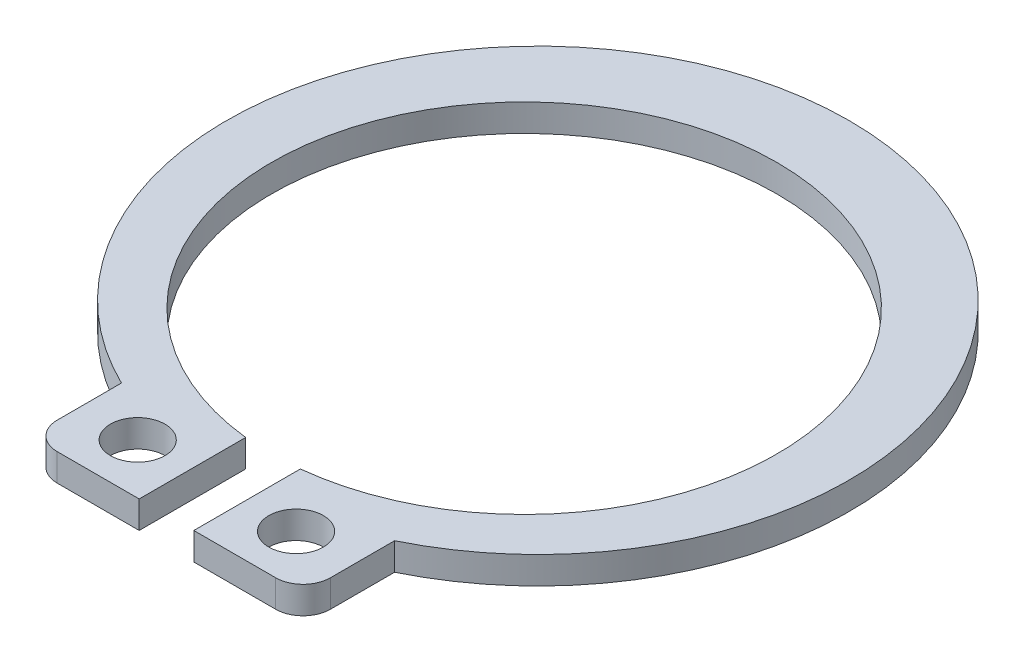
ISO-10303-21;
HEADER;
FILE_DESCRIPTION(('STEP AP214'),'2;1');
FILE_NAME('part.step','',(''),(''),'','','');
FILE_SCHEMA(('AUTOMOTIVE_DESIGN { 1 0 10303 214 1 1 1 1 }'));
ENDSEC;
DATA;
#1=APPLICATION_CONTEXT('core data for automotive mechanical design processes');
#2=APPLICATION_PROTOCOL_DEFINITION('international standard','automotive_design',2000,#1);
#3=PRODUCT_CONTEXT('',#1,'mechanical');
#4=PRODUCT('Part','Part','',(#3));
#5=PRODUCT_RELATED_PRODUCT_CATEGORY('part','',(#4));
#6=PRODUCT_DEFINITION_FORMATION('','',#4);
#7=PRODUCT_DEFINITION_CONTEXT('part definition',#1,'design');
#8=PRODUCT_DEFINITION('design','',#6,#7);
#9=PRODUCT_DEFINITION_SHAPE('','',#8);
#10=(LENGTH_UNIT() NAMED_UNIT(*) SI_UNIT(.MILLI.,.METRE.));
#11=(NAMED_UNIT(*) PLANE_ANGLE_UNIT() SI_UNIT($,.RADIAN.));
#12=(NAMED_UNIT(*) SI_UNIT($,.STERADIAN.) SOLID_ANGLE_UNIT());
#13=UNCERTAINTY_MEASURE_WITH_UNIT(LENGTH_MEASURE(1.E-05),#10,'distance_accuracy_value','');
#14=(GEOMETRIC_REPRESENTATION_CONTEXT(3) GLOBAL_UNCERTAINTY_ASSIGNED_CONTEXT((#13)) GLOBAL_UNIT_ASSIGNED_CONTEXT((#10,
#11,#12)) REPRESENTATION_CONTEXT('',''));
#15=CARTESIAN_POINT('',(0.,0.,0.));
#16=DIRECTION('',(0.,0.,1.));
#17=DIRECTION('',(1.,0.,0.));
#18=AXIS2_PLACEMENT_3D('',#15,#16,#17);
#19=CARTESIAN_POINT('',(0.,1.,0.));
#20=DIRECTION('',(0.,1.,0.));
#21=DIRECTION('',(0.,0.,1.));
#22=AXIS2_PLACEMENT_3D('',#19,#20,#21);
#23=PLANE('',#22);
#24=CARTESIAN_POINT('',(-2.89999999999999,1.,11.25));
#25=DIRECTION('',(0.,1.,0.));
#26=DIRECTION('',(0.,0.,1.));
#27=AXIS2_PLACEMENT_3D('',#24,#25,#26);
#28=CIRCLE('',#27,1.);
#29=CARTESIAN_POINT('',(-2.89999999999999,1.,12.25));
#30=VERTEX_POINT('',#29);
#31=EDGE_CURVE('E146',#30,#30,#28,.T.);
#32=ORIENTED_EDGE('',*,*,#31,.F.);
#33=EDGE_LOOP('',(#32));
#34=FACE_BOUND('',#33,.T.);
#35=CARTESIAN_POINT('',(0.,1.,0.));
#36=DIRECTION('',(0.,-1.,0.));
#37=DIRECTION('',(0.,0.,1.));
#38=AXIS2_PLACEMENT_3D('',#35,#36,#37);
#39=CIRCLE('',#38,9.25);
#40=CARTESIAN_POINT('',(-0.999999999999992,1.,9.19578707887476));
#41=VERTEX_POINT('',#40);
#42=CARTESIAN_POINT('',(1.00000000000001,1.,9.19578707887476));
#43=VERTEX_POINT('',#42);
#44=EDGE_CURVE('E161',#41,#43,#39,.T.);
#45=ORIENTED_EDGE('',*,*,#44,.T.);
#46=DIRECTION('',(0.,0.,1.));
#47=VECTOR('',#46,1.);
#48=CARTESIAN_POINT('',(1.00000000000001,1.,9.19578707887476));
#49=LINE('',#48,#47);
#50=CARTESIAN_POINT('',(1.00000000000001,1.,13.0957870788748));
#51=VERTEX_POINT('',#50);
#52=EDGE_CURVE('E99',#43,#51,#49,.T.);
#53=ORIENTED_EDGE('',*,*,#52,.T.);
#54=DIRECTION('',(1.,0.,0.));
#55=VECTOR('',#54,1.);
#56=CARTESIAN_POINT('',(1.00000000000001,1.,13.0957870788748));
#57=LINE('',#56,#55);
#58=CARTESIAN_POINT('',(4.00000000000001,1.,13.0957870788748));
#59=VERTEX_POINT('',#58);
#60=EDGE_CURVE('E182',#51,#59,#57,.T.);
#61=ORIENTED_EDGE('',*,*,#60,.T.);
#62=CARTESIAN_POINT('',(4.00000000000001,1.,12.0957870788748));
#63=DIRECTION('',(0.,1.,0.));
#64=DIRECTION('',(0.,0.,1.));
#65=AXIS2_PLACEMENT_3D('',#62,#63,#64);
#66=CIRCLE('',#65,1.);
#67=CARTESIAN_POINT('',(5.00000000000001,1.,12.0957870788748));
#68=VERTEX_POINT('',#67);
#69=EDGE_CURVE('E201',#59,#68,#66,.T.);
#70=ORIENTED_EDGE('',*,*,#69,.T.);
#71=DIRECTION('',(0.,0.,-1.));
#72=VECTOR('',#71,1.);
#73=CARTESIAN_POINT('',(5.00000000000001,1.,9.74499877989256));
#74=LINE('',#73,#72);
#75=CARTESIAN_POINT('',(5.00000000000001,1.,9.74499877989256));
#76=VERTEX_POINT('',#75);
#77=EDGE_CURVE('E198',#68,#76,#74,.T.);
#78=ORIENTED_EDGE('',*,*,#77,.T.);
#79=CARTESIAN_POINT('',(0.,1.,-0.5));
#80=DIRECTION('',(0.,1.,0.));
#81=DIRECTION('',(0.,0.,1.));
#82=AXIS2_PLACEMENT_3D('',#79,#80,#81);
#83=CIRCLE('',#82,11.4);
#84=CARTESIAN_POINT('',(-4.99999999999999,1.,9.74499877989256));
#85=VERTEX_POINT('',#84);
#86=EDGE_CURVE('E200',#76,#85,#83,.T.);
#87=ORIENTED_EDGE('',*,*,#86,.T.);
#88=DIRECTION('',(0.,0.,1.));
#89=VECTOR('',#88,1.);
#90=CARTESIAN_POINT('',(-4.99999999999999,1.,9.74499877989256));
#91=LINE('',#90,#89);
#92=CARTESIAN_POINT('',(-4.99999999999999,1.,12.0957870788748));
#93=VERTEX_POINT('',#92);
#94=EDGE_CURVE('E124',#85,#93,#91,.T.);
#95=ORIENTED_EDGE('',*,*,#94,.T.);
#96=CARTESIAN_POINT('',(-3.99999999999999,1.,12.0957870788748));
#97=DIRECTION('',(0.,1.,0.));
#98=DIRECTION('',(0.,0.,1.));
#99=AXIS2_PLACEMENT_3D('',#96,#97,#98);
#100=CIRCLE('',#99,1.);
#101=CARTESIAN_POINT('',(-3.99999999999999,1.,13.0957870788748));
#102=VERTEX_POINT('',#101);
#103=EDGE_CURVE('E118',#93,#102,#100,.T.);
#104=ORIENTED_EDGE('',*,*,#103,.T.);
#105=DIRECTION('',(1.,0.,0.));
#106=VECTOR('',#105,1.);
#107=CARTESIAN_POINT('',(-3.99999999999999,1.,13.0957870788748));
#108=LINE('',#107,#106);
#109=CARTESIAN_POINT('',(-0.999999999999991,1.,13.0957870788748));
#110=VERTEX_POINT('',#109);
#111=EDGE_CURVE('E122',#102,#110,#108,.T.);
#112=ORIENTED_EDGE('',*,*,#111,.T.);
#113=DIRECTION('',(0.,0.,-1.));
#114=VECTOR('',#113,1.);
#115=CARTESIAN_POINT('',(-0.999999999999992,1.,9.19578707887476));
#116=LINE('',#115,#114);
#117=EDGE_CURVE('E50',#110,#41,#116,.T.);
#118=ORIENTED_EDGE('',*,*,#117,.T.);
#119=EDGE_LOOP('',(#45,#53,#61,#70,#78,#87,#95,#104,#112,#118));
#120=FACE_BOUND('',#119,.T.);
#121=CARTESIAN_POINT('',(2.90000000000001,1.,11.25));
#122=DIRECTION('',(0.,1.,0.));
#123=DIRECTION('',(0.,0.,-1.));
#124=AXIS2_PLACEMENT_3D('',#121,#122,#123);
#125=CIRCLE('',#124,1.);
#126=CARTESIAN_POINT('',(2.90000000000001,1.,10.25));
#127=VERTEX_POINT('',#126);
#128=EDGE_CURVE('E212',#127,#127,#125,.T.);
#129=ORIENTED_EDGE('',*,*,#128,.F.);
#130=EDGE_LOOP('',(#129));
#131=FACE_BOUND('',#130,.T.);
#132=ADVANCED_FACE('F33',(#34,#120,#131),#23,.T.);
#133=CARTESIAN_POINT('',(0.,0.,0.));
#134=DIRECTION('',(0.,1.,0.));
#135=DIRECTION('',(0.,0.,1.));
#136=AXIS2_PLACEMENT_3D('',#133,#134,#135);
#137=PLANE('',#136);
#138=CARTESIAN_POINT('',(-2.89999999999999,0.,11.25));
#139=DIRECTION('',(0.,1.,0.));
#140=DIRECTION('',(0.,0.,1.));
#141=AXIS2_PLACEMENT_3D('',#138,#139,#140);
#142=CIRCLE('',#141,1.);
#143=CARTESIAN_POINT('',(-2.89999999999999,0.,12.25));
#144=VERTEX_POINT('',#143);
#145=EDGE_CURVE('E209',#144,#144,#142,.T.);
#146=ORIENTED_EDGE('',*,*,#145,.T.);
#147=EDGE_LOOP('',(#146));
#148=FACE_BOUND('',#147,.T.);
#149=CARTESIAN_POINT('',(0.,0.,0.));
#150=DIRECTION('',(0.,-1.,0.));
#151=DIRECTION('',(0.,0.,1.));
#152=AXIS2_PLACEMENT_3D('',#149,#150,#151);
#153=CIRCLE('',#152,9.25);
#154=CARTESIAN_POINT('',(-0.999999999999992,0.,9.19578707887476));
#155=VERTEX_POINT('',#154);
#156=CARTESIAN_POINT('',(1.00000000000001,0.,9.19578707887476));
#157=VERTEX_POINT('',#156);
#158=EDGE_CURVE('E142',#155,#157,#153,.T.);
#159=ORIENTED_EDGE('',*,*,#158,.F.);
#160=DIRECTION('',(0.,0.,-1.));
#161=VECTOR('',#160,1.);
#162=CARTESIAN_POINT('',(-0.999999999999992,0.,9.19578707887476));
#163=LINE('',#162,#161);
#164=CARTESIAN_POINT('',(-0.999999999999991,0.,13.0957870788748));
#165=VERTEX_POINT('',#164);
#166=EDGE_CURVE('E91',#165,#155,#163,.T.);
#167=ORIENTED_EDGE('',*,*,#166,.F.);
#168=DIRECTION('',(1.,0.,0.));
#169=VECTOR('',#168,1.);
#170=CARTESIAN_POINT('',(-3.99999999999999,0.,13.0957870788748));
#171=LINE('',#170,#169);
#172=CARTESIAN_POINT('',(-3.99999999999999,0.,13.0957870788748));
#173=VERTEX_POINT('',#172);
#174=EDGE_CURVE('E85',#173,#165,#171,.T.);
#175=ORIENTED_EDGE('',*,*,#174,.F.);
#176=CARTESIAN_POINT('',(-3.99999999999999,0.,12.0957870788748));
#177=DIRECTION('',(0.,1.,0.));
#178=DIRECTION('',(0.,0.,1.));
#179=AXIS2_PLACEMENT_3D('',#176,#177,#178);
#180=CIRCLE('',#179,1.);
#181=CARTESIAN_POINT('',(-4.99999999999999,0.,12.0957870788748));
#182=VERTEX_POINT('',#181);
#183=EDGE_CURVE('E132',#182,#173,#180,.T.);
#184=ORIENTED_EDGE('',*,*,#183,.F.);
#185=DIRECTION('',(0.,0.,1.));
#186=VECTOR('',#185,1.);
#187=CARTESIAN_POINT('',(-4.99999999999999,0.,9.74499877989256));
#188=LINE('',#187,#186);
#189=CARTESIAN_POINT('',(-4.99999999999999,0.,9.74499877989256));
#190=VERTEX_POINT('',#189);
#191=EDGE_CURVE('E156',#190,#182,#188,.T.);
#192=ORIENTED_EDGE('',*,*,#191,.F.);
#193=CARTESIAN_POINT('',(0.,0.,-0.5));
#194=DIRECTION('',(0.,1.,0.));
#195=DIRECTION('',(0.,0.,1.));
#196=AXIS2_PLACEMENT_3D('',#193,#194,#195);
#197=CIRCLE('',#196,11.4);
#198=CARTESIAN_POINT('',(5.00000000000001,0.,9.74499877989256));
#199=VERTEX_POINT('',#198);
#200=EDGE_CURVE('E154',#199,#190,#197,.T.);
#201=ORIENTED_EDGE('',*,*,#200,.F.);
#202=DIRECTION('',(0.,0.,-1.));
#203=VECTOR('',#202,1.);
#204=CARTESIAN_POINT('',(5.00000000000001,0.,9.74499877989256));
#205=LINE('',#204,#203);
#206=CARTESIAN_POINT('',(5.00000000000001,0.,12.0957870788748));
#207=VERTEX_POINT('',#206);
#208=EDGE_CURVE('E152',#207,#199,#205,.T.);
#209=ORIENTED_EDGE('',*,*,#208,.F.);
#210=CARTESIAN_POINT('',(4.00000000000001,0.,12.0957870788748));
#211=DIRECTION('',(0.,1.,0.));
#212=DIRECTION('',(0.,0.,1.));
#213=AXIS2_PLACEMENT_3D('',#210,#211,#212);
#214=CIRCLE('',#213,1.);
#215=CARTESIAN_POINT('',(4.00000000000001,0.,13.0957870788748));
#216=VERTEX_POINT('',#215);
#217=EDGE_CURVE('E150',#216,#207,#214,.T.);
#218=ORIENTED_EDGE('',*,*,#217,.F.);
#219=DIRECTION('',(1.,0.,0.));
#220=VECTOR('',#219,1.);
#221=CARTESIAN_POINT('',(1.00000000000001,0.,13.0957870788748));
#222=LINE('',#221,#220);
#223=CARTESIAN_POINT('',(1.00000000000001,0.,13.0957870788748));
#224=VERTEX_POINT('',#223);
#225=EDGE_CURVE('E148',#224,#216,#222,.T.);
#226=ORIENTED_EDGE('',*,*,#225,.F.);
#227=DIRECTION('',(0.,0.,1.));
#228=VECTOR('',#227,1.);
#229=CARTESIAN_POINT('',(1.00000000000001,0.,9.19578707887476));
#230=LINE('',#229,#228);
#231=EDGE_CURVE('E145',#157,#224,#230,.T.);
#232=ORIENTED_EDGE('',*,*,#231,.F.);
#233=EDGE_LOOP('',(#159,#167,#175,#184,#192,#201,#209,#218,#226,#232));
#234=FACE_BOUND('',#233,.T.);
#235=CARTESIAN_POINT('',(2.90000000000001,0.,11.25));
#236=DIRECTION('',(0.,1.,0.));
#237=DIRECTION('',(0.,0.,-1.));
#238=AXIS2_PLACEMENT_3D('',#235,#236,#237);
#239=CIRCLE('',#238,1.);
#240=CARTESIAN_POINT('',(2.90000000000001,0.,10.25));
#241=VERTEX_POINT('',#240);
#242=EDGE_CURVE('E215',#241,#241,#239,.T.);
#243=ORIENTED_EDGE('',*,*,#242,.T.);
#244=EDGE_LOOP('',(#243));
#245=FACE_BOUND('',#244,.T.);
#246=ADVANCED_FACE('F186',(#148,#234,#245),#137,.F.);
#247=CARTESIAN_POINT('',(0.,1.,0.));
#248=DIRECTION('',(0.,-1.,0.));
#249=DIRECTION('',(0.,0.,-1.));
#250=AXIS2_PLACEMENT_3D('',#247,#248,#249);
#251=CYLINDRICAL_SURFACE('',#250,9.25);
#252=ORIENTED_EDGE('',*,*,#158,.T.);
#253=DIRECTION('',(0.,-1.,0.));
#254=VECTOR('',#253,1.);
#255=CARTESIAN_POINT('',(1.00000000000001,1.,9.19578707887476));
#256=LINE('',#255,#254);
#257=EDGE_CURVE('E11',#43,#157,#256,.T.);
#258=ORIENTED_EDGE('',*,*,#257,.F.);
#259=ORIENTED_EDGE('',*,*,#44,.F.);
#260=DIRECTION('',(0.,-1.,0.));
#261=VECTOR('',#260,1.);
#262=CARTESIAN_POINT('',(-0.999999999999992,1.,9.19578707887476));
#263=LINE('',#262,#261);
#264=EDGE_CURVE('E138',#41,#155,#263,.T.);
#265=ORIENTED_EDGE('',*,*,#264,.T.);
#266=EDGE_LOOP('',(#252,#258,#259,#265));
#267=FACE_BOUND('',#266,.T.);
#268=ADVANCED_FACE('F35',(#267),#251,.F.);
#269=CARTESIAN_POINT('',(1.00000000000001,1.,9.19578707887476));
#270=DIRECTION('',(1.,0.,0.));
#271=DIRECTION('',(0.,0.,-1.));
#272=AXIS2_PLACEMENT_3D('',#269,#270,#271);
#273=PLANE('',#272);
#274=ORIENTED_EDGE('',*,*,#231,.T.);
#275=DIRECTION('',(0.,-1.,0.));
#276=VECTOR('',#275,1.);
#277=CARTESIAN_POINT('',(1.00000000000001,1.,13.0957870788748));
#278=LINE('',#277,#276);
#279=EDGE_CURVE('E42',#51,#224,#278,.T.);
#280=ORIENTED_EDGE('',*,*,#279,.F.);
#281=ORIENTED_EDGE('',*,*,#52,.F.);
#282=ORIENTED_EDGE('',*,*,#257,.T.);
#283=EDGE_LOOP('',(#274,#280,#281,#282));
#284=FACE_BOUND('',#283,.T.);
#285=ADVANCED_FACE('F256',(#284),#273,.F.);
#286=CARTESIAN_POINT('',(1.00000000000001,1.,13.0957870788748));
#287=DIRECTION('',(0.,0.,-1.));
#288=DIRECTION('',(-1.,0.,0.));
#289=AXIS2_PLACEMENT_3D('',#286,#287,#288);
#290=PLANE('',#289);
#291=ORIENTED_EDGE('',*,*,#225,.T.);
#292=DIRECTION('',(0.,-1.,0.));
#293=VECTOR('',#292,1.);
#294=CARTESIAN_POINT('',(4.00000000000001,1.,13.0957870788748));
#295=LINE('',#294,#293);
#296=EDGE_CURVE('E174',#59,#216,#295,.T.);
#297=ORIENTED_EDGE('',*,*,#296,.F.);
#298=ORIENTED_EDGE('',*,*,#60,.F.);
#299=ORIENTED_EDGE('',*,*,#279,.T.);
#300=EDGE_LOOP('',(#291,#297,#298,#299));
#301=FACE_BOUND('',#300,.T.);
#302=ADVANCED_FACE('F180',(#301),#290,.F.);
#303=CARTESIAN_POINT('',(4.00000000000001,1.,12.0957870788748));
#304=DIRECTION('',(0.,-1.,0.));
#305=DIRECTION('',(0.,0.,-1.));
#306=AXIS2_PLACEMENT_3D('',#303,#304,#305);
#307=CYLINDRICAL_SURFACE('',#306,1.);
#308=ORIENTED_EDGE('',*,*,#217,.T.);
#309=DIRECTION('',(0.,-1.,0.));
#310=VECTOR('',#309,1.);
#311=CARTESIAN_POINT('',(5.00000000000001,1.,12.0957870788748));
#312=LINE('',#311,#310);
#313=EDGE_CURVE('E171',#68,#207,#312,.T.);
#314=ORIENTED_EDGE('',*,*,#313,.F.);
#315=ORIENTED_EDGE('',*,*,#69,.F.);
#316=ORIENTED_EDGE('',*,*,#296,.T.);
#317=EDGE_LOOP('',(#308,#314,#315,#316));
#318=FACE_BOUND('',#317,.T.);
#319=ADVANCED_FACE('F192',(#318),#307,.T.);
#320=CARTESIAN_POINT('',(5.00000000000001,1.,9.74499877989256));
#321=DIRECTION('',(-1.,0.,0.));
#322=DIRECTION('',(0.,0.,1.));
#323=AXIS2_PLACEMENT_3D('',#320,#321,#322);
#324=PLANE('',#323);
#325=ORIENTED_EDGE('',*,*,#208,.T.);
#326=DIRECTION('',(0.,-1.,0.));
#327=VECTOR('',#326,1.);
#328=CARTESIAN_POINT('',(5.00000000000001,1.,9.74499877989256));
#329=LINE('',#328,#327);
#330=EDGE_CURVE('E168',#76,#199,#329,.T.);
#331=ORIENTED_EDGE('',*,*,#330,.F.);
#332=ORIENTED_EDGE('',*,*,#77,.F.);
#333=ORIENTED_EDGE('',*,*,#313,.T.);
#334=EDGE_LOOP('',(#325,#331,#332,#333));
#335=FACE_BOUND('',#334,.T.);
#336=ADVANCED_FACE('F196',(#335),#324,.F.);
#337=CARTESIAN_POINT('',(0.,1.,-0.5));
#338=DIRECTION('',(0.,-1.,0.));
#339=DIRECTION('',(0.,0.,-1.));
#340=AXIS2_PLACEMENT_3D('',#337,#338,#339);
#341=CYLINDRICAL_SURFACE('',#340,11.4);
#342=ORIENTED_EDGE('',*,*,#200,.T.);
#343=DIRECTION('',(0.,-1.,0.));
#344=VECTOR('',#343,1.);
#345=CARTESIAN_POINT('',(-4.99999999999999,1.,9.74499877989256));
#346=LINE('',#345,#344);
#347=EDGE_CURVE('E165',#85,#190,#346,.T.);
#348=ORIENTED_EDGE('',*,*,#347,.F.);
#349=ORIENTED_EDGE('',*,*,#86,.F.);
#350=ORIENTED_EDGE('',*,*,#330,.T.);
#351=EDGE_LOOP('',(#342,#348,#349,#350));
#352=FACE_BOUND('',#351,.T.);
#353=ADVANCED_FACE('F246',(#352),#341,.T.);
#354=CARTESIAN_POINT('',(-4.99999999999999,1.,9.74499877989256));
#355=DIRECTION('',(1.,0.,0.));
#356=DIRECTION('',(0.,0.,-1.));
#357=AXIS2_PLACEMENT_3D('',#354,#355,#356);
#358=PLANE('',#357);
#359=ORIENTED_EDGE('',*,*,#191,.T.);
#360=DIRECTION('',(0.,-1.,0.));
#361=VECTOR('',#360,1.);
#362=CARTESIAN_POINT('',(-4.99999999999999,1.,12.0957870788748));
#363=LINE('',#362,#361);
#364=EDGE_CURVE('E133',#93,#182,#363,.T.);
#365=ORIENTED_EDGE('',*,*,#364,.F.);
#366=ORIENTED_EDGE('',*,*,#94,.F.);
#367=ORIENTED_EDGE('',*,*,#347,.T.);
#368=EDGE_LOOP('',(#359,#365,#366,#367));
#369=FACE_BOUND('',#368,.T.);
#370=ADVANCED_FACE('F243',(#369),#358,.F.);
#371=CARTESIAN_POINT('',(-3.99999999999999,1.,12.0957870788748));
#372=DIRECTION('',(0.,-1.,0.));
#373=DIRECTION('',(0.,0.,-1.));
#374=AXIS2_PLACEMENT_3D('',#371,#372,#373);
#375=CYLINDRICAL_SURFACE('',#374,1.);
#376=ORIENTED_EDGE('',*,*,#183,.T.);
#377=DIRECTION('',(0.,-1.,0.));
#378=VECTOR('',#377,1.);
#379=CARTESIAN_POINT('',(-3.99999999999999,1.,13.0957870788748));
#380=LINE('',#379,#378);
#381=EDGE_CURVE('E129',#102,#173,#380,.T.);
#382=ORIENTED_EDGE('',*,*,#381,.F.);
#383=ORIENTED_EDGE('',*,*,#103,.F.);
#384=ORIENTED_EDGE('',*,*,#364,.T.);
#385=EDGE_LOOP('',(#376,#382,#383,#384));
#386=FACE_BOUND('',#385,.T.);
#387=ADVANCED_FACE('F130',(#386),#375,.T.);
#388=CARTESIAN_POINT('',(-3.99999999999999,1.,13.0957870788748));
#389=DIRECTION('',(0.,0.,-1.));
#390=DIRECTION('',(-1.,0.,0.));
#391=AXIS2_PLACEMENT_3D('',#388,#389,#390);
#392=PLANE('',#391);
#393=ORIENTED_EDGE('',*,*,#174,.T.);
#394=DIRECTION('',(0.,-1.,0.));
#395=VECTOR('',#394,1.);
#396=CARTESIAN_POINT('',(-0.999999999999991,1.,13.0957870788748));
#397=LINE('',#396,#395);
#398=EDGE_CURVE('E134',#110,#165,#397,.T.);
#399=ORIENTED_EDGE('',*,*,#398,.F.);
#400=ORIENTED_EDGE('',*,*,#111,.F.);
#401=ORIENTED_EDGE('',*,*,#381,.T.);
#402=EDGE_LOOP('',(#393,#399,#400,#401));
#403=FACE_BOUND('',#402,.T.);
#404=ADVANCED_FACE('F136',(#403),#392,.F.);
#405=CARTESIAN_POINT('',(-0.999999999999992,1.,9.19578707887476));
#406=DIRECTION('',(-1.,0.,0.));
#407=DIRECTION('',(0.,0.,1.));
#408=AXIS2_PLACEMENT_3D('',#405,#406,#407);
#409=PLANE('',#408);
#410=ORIENTED_EDGE('',*,*,#166,.T.);
#411=ORIENTED_EDGE('',*,*,#264,.F.);
#412=ORIENTED_EDGE('',*,*,#117,.F.);
#413=ORIENTED_EDGE('',*,*,#398,.T.);
#414=EDGE_LOOP('',(#410,#411,#412,#413));
#415=FACE_BOUND('',#414,.T.);
#416=ADVANCED_FACE('F236',(#415),#409,.F.);
#417=CARTESIAN_POINT('',(-2.89999999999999,1.,11.25));
#418=DIRECTION('',(0.,-1.,0.));
#419=DIRECTION('',(0.,0.,-1.));
#420=AXIS2_PLACEMENT_3D('',#417,#418,#419);
#421=CYLINDRICAL_SURFACE('',#420,1.);
#422=ORIENTED_EDGE('',*,*,#31,.T.);
#423=EDGE_LOOP('',(#422));
#424=FACE_BOUND('',#423,.T.);
#425=ORIENTED_EDGE('',*,*,#145,.F.);
#426=EDGE_LOOP('',(#425));
#427=FACE_BOUND('',#426,.T.);
#428=ADVANCED_FACE('F233',(#424,#427),#421,.F.);
#429=CARTESIAN_POINT('',(2.90000000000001,1.,11.25));
#430=DIRECTION('',(0.,-1.,0.));
#431=DIRECTION('',(0.,0.,-1.));
#432=AXIS2_PLACEMENT_3D('',#429,#430,#431);
#433=CYLINDRICAL_SURFACE('',#432,1.);
#434=ORIENTED_EDGE('',*,*,#128,.T.);
#435=EDGE_LOOP('',(#434));
#436=FACE_BOUND('',#435,.T.);
#437=ORIENTED_EDGE('',*,*,#242,.F.);
#438=EDGE_LOOP('',(#437));
#439=FACE_BOUND('',#438,.T.);
#440=ADVANCED_FACE('F221',(#436,#439),#433,.F.);
#441=CLOSED_SHELL('',(#132,#246,#268,#285,#302,#319,#336,#353,#370,#387,#404,#416,#428,#440));
#442=MANIFOLD_SOLID_BREP('B2',#441);
#443=ADVANCED_BREP_SHAPE_REPRESENTATION('',(#18,#442),#14);
#444=SHAPE_DEFINITION_REPRESENTATION(#9,#443);
ENDSEC;
END-ISO-10303-21;
